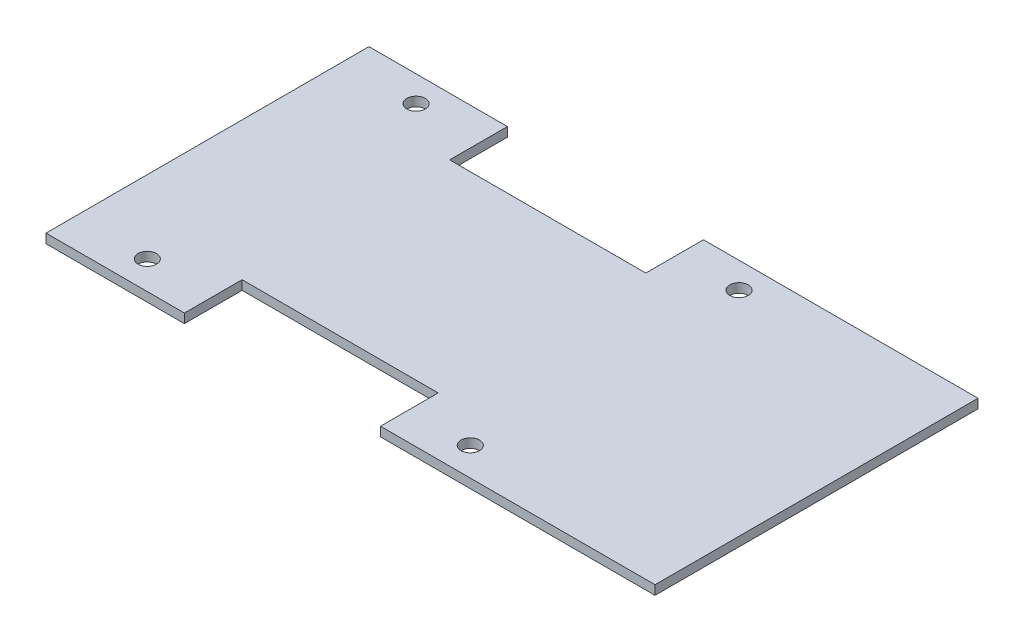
ISO-10303-21;
HEADER;
FILE_DESCRIPTION(('STEP AP214'),'2;1');
FILE_NAME('part.step','',(''),(''),'','','');
FILE_SCHEMA(('AUTOMOTIVE_DESIGN { 1 0 10303 214 1 1 1 1 }'));
ENDSEC;
DATA;
#1=APPLICATION_CONTEXT('core data for automotive mechanical design processes');
#2=APPLICATION_PROTOCOL_DEFINITION('international standard','automotive_design',2000,#1);
#3=PRODUCT_CONTEXT('',#1,'mechanical');
#4=PRODUCT('Part','Part','',(#3));
#5=PRODUCT_RELATED_PRODUCT_CATEGORY('part','',(#4));
#6=PRODUCT_DEFINITION_FORMATION('','',#4);
#7=PRODUCT_DEFINITION_CONTEXT('part definition',#1,'design');
#8=PRODUCT_DEFINITION('design','',#6,#7);
#9=PRODUCT_DEFINITION_SHAPE('','',#8);
#10=(LENGTH_UNIT() NAMED_UNIT(*) SI_UNIT(.MILLI.,.METRE.));
#11=(NAMED_UNIT(*) PLANE_ANGLE_UNIT() SI_UNIT($,.RADIAN.));
#12=(NAMED_UNIT(*) SI_UNIT($,.STERADIAN.) SOLID_ANGLE_UNIT());
#13=UNCERTAINTY_MEASURE_WITH_UNIT(LENGTH_MEASURE(1.E-05),#10,'distance_accuracy_value','');
#14=(GEOMETRIC_REPRESENTATION_CONTEXT(3) GLOBAL_UNCERTAINTY_ASSIGNED_CONTEXT((#13)) GLOBAL_UNIT_ASSIGNED_CONTEXT((#10,
#11,#12)) REPRESENTATION_CONTEXT('',''));
#15=CARTESIAN_POINT('',(0.,0.,0.));
#16=DIRECTION('',(0.,0.,1.));
#17=DIRECTION('',(1.,0.,0.));
#18=AXIS2_PLACEMENT_3D('',#15,#16,#17);
#19=CARTESIAN_POINT('',(-238.,-8.,-230.));
#20=DIRECTION('',(0.,0.,-1.));
#21=DIRECTION('',(-1.,0.,0.));
#22=AXIS2_PLACEMENT_3D('',#19,#20,#21);
#23=PLANE('',#22);
#24=DIRECTION('',(-1.,0.,0.));
#25=VECTOR('',#24,1.);
#26=CARTESIAN_POINT('',(-238.,0.,-230.));
#27=LINE('',#26,#25);
#28=CARTESIAN_POINT('',(-238.,0.,-230.));
#29=VERTEX_POINT('',#28);
#30=CARTESIAN_POINT('',(-408.,0.,-230.));
#31=VERTEX_POINT('',#30);
#32=EDGE_CURVE('E159',#29,#31,#27,.T.);
#33=ORIENTED_EDGE('',*,*,#32,.F.);
#34=DIRECTION('',(0.,1.,0.));
#35=VECTOR('',#34,1.);
#36=CARTESIAN_POINT('',(-238.,-8.,-230.));
#37=LINE('',#36,#35);
#38=CARTESIAN_POINT('',(-238.,-8.,-230.));
#39=VERTEX_POINT('',#38);
#40=EDGE_CURVE('E11',#39,#29,#37,.T.);
#41=ORIENTED_EDGE('',*,*,#40,.F.);
#42=DIRECTION('',(-1.,0.,0.));
#43=VECTOR('',#42,1.);
#44=CARTESIAN_POINT('',(-238.,-8.,-230.));
#45=LINE('',#44,#43);
#46=CARTESIAN_POINT('',(-408.,-8.,-230.));
#47=VERTEX_POINT('',#46);
#48=EDGE_CURVE('E192',#39,#47,#45,.T.);
#49=ORIENTED_EDGE('',*,*,#48,.T.);
#50=DIRECTION('',(0.,1.,0.));
#51=VECTOR('',#50,1.);
#52=CARTESIAN_POINT('',(-408.,-8.,-230.));
#53=LINE('',#52,#51);
#54=EDGE_CURVE('E41',#47,#31,#53,.T.);
#55=ORIENTED_EDGE('',*,*,#54,.T.);
#56=EDGE_LOOP('',(#33,#41,#49,#55));
#57=FACE_BOUND('',#56,.T.);
#58=ADVANCED_FACE('F38',(#57),#23,.T.);
#59=CARTESIAN_POINT('',(-238.,-8.,-230.));
#60=DIRECTION('',(-1.,0.,0.));
#61=DIRECTION('',(0.,0.,1.));
#62=AXIS2_PLACEMENT_3D('',#59,#60,#61);
#63=PLANE('',#62);
#64=DIRECTION('',(0.,0.,1.));
#65=VECTOR('',#64,1.);
#66=CARTESIAN_POINT('',(-238.,0.,-230.));
#67=LINE('',#66,#65);
#68=CARTESIAN_POINT('',(-238.,0.,-280.));
#69=VERTEX_POINT('',#68);
#70=EDGE_CURVE('E190',#69,#29,#67,.T.);
#71=ORIENTED_EDGE('',*,*,#70,.F.);
#72=DIRECTION('',(0.,1.,0.));
#73=VECTOR('',#72,1.);
#74=CARTESIAN_POINT('',(-238.,-8.,-280.));
#75=LINE('',#74,#73);
#76=CARTESIAN_POINT('',(-238.,-8.,-280.));
#77=VERTEX_POINT('',#76);
#78=EDGE_CURVE('E47',#77,#69,#75,.T.);
#79=ORIENTED_EDGE('',*,*,#78,.F.);
#80=DIRECTION('',(0.,0.,1.));
#81=VECTOR('',#80,1.);
#82=CARTESIAN_POINT('',(-238.,-8.,-230.));
#83=LINE('',#82,#81);
#84=EDGE_CURVE('E149',#77,#39,#83,.T.);
#85=ORIENTED_EDGE('',*,*,#84,.T.);
#86=ORIENTED_EDGE('',*,*,#40,.T.);
#87=EDGE_LOOP('',(#71,#79,#85,#86));
#88=FACE_BOUND('',#87,.T.);
#89=ADVANCED_FACE('F212',(#88),#63,.T.);
#90=CARTESIAN_POINT('',(-238.,-8.,-280.));
#91=DIRECTION('',(0.,0.,-1.));
#92=DIRECTION('',(-1.,0.,0.));
#93=AXIS2_PLACEMENT_3D('',#90,#91,#92);
#94=PLANE('',#93);
#95=DIRECTION('',(-1.,0.,0.));
#96=VECTOR('',#95,1.);
#97=CARTESIAN_POINT('',(-238.,0.,-280.));
#98=LINE('',#97,#96);
#99=CARTESIAN_POINT('',(0.,0.,-280.));
#100=VERTEX_POINT('',#99);
#101=EDGE_CURVE('E136',#100,#69,#98,.T.);
#102=ORIENTED_EDGE('',*,*,#101,.F.);
#103=DIRECTION('',(0.,1.,0.));
#104=VECTOR('',#103,1.);
#105=CARTESIAN_POINT('',(0.,-8.,-280.));
#106=LINE('',#105,#104);
#107=CARTESIAN_POINT('',(0.,-8.,-280.));
#108=VERTEX_POINT('',#107);
#109=EDGE_CURVE('E131',#108,#100,#106,.T.);
#110=ORIENTED_EDGE('',*,*,#109,.F.);
#111=DIRECTION('',(-1.,0.,0.));
#112=VECTOR('',#111,1.);
#113=CARTESIAN_POINT('',(-238.,-8.,-280.));
#114=LINE('',#113,#112);
#115=EDGE_CURVE('E134',#108,#77,#114,.T.);
#116=ORIENTED_EDGE('',*,*,#115,.T.);
#117=ORIENTED_EDGE('',*,*,#78,.T.);
#118=EDGE_LOOP('',(#102,#110,#116,#117));
#119=FACE_BOUND('',#118,.T.);
#120=ADVANCED_FACE('F133',(#119),#94,.T.);
#121=CARTESIAN_POINT('',(0.,-8.,0.));
#122=DIRECTION('',(1.,0.,0.));
#123=DIRECTION('',(0.,0.,-1.));
#124=AXIS2_PLACEMENT_3D('',#121,#122,#123);
#125=PLANE('',#124);
#126=DIRECTION('',(0.,0.,-1.));
#127=VECTOR('',#126,1.);
#128=CARTESIAN_POINT('',(0.,0.,0.));
#129=LINE('',#128,#127);
#130=CARTESIAN_POINT('',(0.,0.,0.));
#131=VERTEX_POINT('',#130);
#132=EDGE_CURVE('E187',#131,#100,#129,.T.);
#133=ORIENTED_EDGE('',*,*,#132,.F.);
#134=DIRECTION('',(0.,1.,0.));
#135=VECTOR('',#134,1.);
#136=CARTESIAN_POINT('',(0.,-8.,0.));
#137=LINE('',#136,#135);
#138=CARTESIAN_POINT('',(0.,-8.,0.));
#139=VERTEX_POINT('',#138);
#140=EDGE_CURVE('E141',#139,#131,#137,.T.);
#141=ORIENTED_EDGE('',*,*,#140,.F.);
#142=DIRECTION('',(0.,0.,-1.));
#143=VECTOR('',#142,1.);
#144=CARTESIAN_POINT('',(0.,-8.,0.));
#145=LINE('',#144,#143);
#146=EDGE_CURVE('E147',#139,#108,#145,.T.);
#147=ORIENTED_EDGE('',*,*,#146,.T.);
#148=ORIENTED_EDGE('',*,*,#109,.T.);
#149=EDGE_LOOP('',(#133,#141,#147,#148));
#150=FACE_BOUND('',#149,.T.);
#151=ADVANCED_FACE('F151',(#150),#125,.T.);
#152=CARTESIAN_POINT('',(0.,-8.,0.));
#153=DIRECTION('',(0.,0.,1.));
#154=DIRECTION('',(1.,0.,0.));
#155=AXIS2_PLACEMENT_3D('',#152,#153,#154);
#156=PLANE('',#155);
#157=DIRECTION('',(1.,0.,0.));
#158=VECTOR('',#157,1.);
#159=CARTESIAN_POINT('',(0.,0.,0.));
#160=LINE('',#159,#158);
#161=CARTESIAN_POINT('',(-238.,0.,0.));
#162=VERTEX_POINT('',#161);
#163=EDGE_CURVE('E184',#162,#131,#160,.T.);
#164=ORIENTED_EDGE('',*,*,#163,.F.);
#165=DIRECTION('',(0.,1.,0.));
#166=VECTOR('',#165,1.);
#167=CARTESIAN_POINT('',(-238.,-8.,0.));
#168=LINE('',#167,#166);
#169=CARTESIAN_POINT('',(-238.,-8.,0.));
#170=VERTEX_POINT('',#169);
#171=EDGE_CURVE('E196',#170,#162,#168,.T.);
#172=ORIENTED_EDGE('',*,*,#171,.F.);
#173=DIRECTION('',(1.,0.,0.));
#174=VECTOR('',#173,1.);
#175=CARTESIAN_POINT('',(0.,-8.,0.));
#176=LINE('',#175,#174);
#177=EDGE_CURVE('E152',#170,#139,#176,.T.);
#178=ORIENTED_EDGE('',*,*,#177,.T.);
#179=ORIENTED_EDGE('',*,*,#140,.T.);
#180=EDGE_LOOP('',(#164,#172,#178,#179));
#181=FACE_BOUND('',#180,.T.);
#182=ADVANCED_FACE('F225',(#181),#156,.T.);
#183=CARTESIAN_POINT('',(-238.,-8.,0.));
#184=DIRECTION('',(-1.,0.,0.));
#185=DIRECTION('',(0.,0.,1.));
#186=AXIS2_PLACEMENT_3D('',#183,#184,#185);
#187=PLANE('',#186);
#188=DIRECTION('',(0.,0.,1.));
#189=VECTOR('',#188,1.);
#190=CARTESIAN_POINT('',(-238.,0.,0.));
#191=LINE('',#190,#189);
#192=CARTESIAN_POINT('',(-238.,0.,-50.));
#193=VERTEX_POINT('',#192);
#194=EDGE_CURVE('E181',#193,#162,#191,.T.);
#195=ORIENTED_EDGE('',*,*,#194,.F.);
#196=DIRECTION('',(0.,1.,0.));
#197=VECTOR('',#196,1.);
#198=CARTESIAN_POINT('',(-238.,-8.,-50.));
#199=LINE('',#198,#197);
#200=CARTESIAN_POINT('',(-238.,-8.,-50.));
#201=VERTEX_POINT('',#200);
#202=EDGE_CURVE('E198',#201,#193,#199,.T.);
#203=ORIENTED_EDGE('',*,*,#202,.F.);
#204=DIRECTION('',(0.,0.,1.));
#205=VECTOR('',#204,1.);
#206=CARTESIAN_POINT('',(-238.,-8.,0.));
#207=LINE('',#206,#205);
#208=EDGE_CURVE('E154',#201,#170,#207,.T.);
#209=ORIENTED_EDGE('',*,*,#208,.T.);
#210=ORIENTED_EDGE('',*,*,#171,.T.);
#211=EDGE_LOOP('',(#195,#203,#209,#210));
#212=FACE_BOUND('',#211,.T.);
#213=ADVANCED_FACE('F228',(#212),#187,.T.);
#214=CARTESIAN_POINT('',(-238.,-8.,-50.));
#215=DIRECTION('',(0.,0.,1.));
#216=DIRECTION('',(1.,0.,0.));
#217=AXIS2_PLACEMENT_3D('',#214,#215,#216);
#218=PLANE('',#217);
#219=DIRECTION('',(1.,0.,0.));
#220=VECTOR('',#219,1.);
#221=CARTESIAN_POINT('',(-238.,0.,-50.));
#222=LINE('',#221,#220);
#223=CARTESIAN_POINT('',(-408.,0.,-50.));
#224=VERTEX_POINT('',#223);
#225=EDGE_CURVE('E178',#224,#193,#222,.T.);
#226=ORIENTED_EDGE('',*,*,#225,.F.);
#227=DIRECTION('',(0.,1.,0.));
#228=VECTOR('',#227,1.);
#229=CARTESIAN_POINT('',(-408.,-8.,-50.));
#230=LINE('',#229,#228);
#231=CARTESIAN_POINT('',(-408.,-8.,-50.));
#232=VERTEX_POINT('',#231);
#233=EDGE_CURVE('E200',#232,#224,#230,.T.);
#234=ORIENTED_EDGE('',*,*,#233,.F.);
#235=DIRECTION('',(1.,0.,0.));
#236=VECTOR('',#235,1.);
#237=CARTESIAN_POINT('',(-238.,-8.,-50.));
#238=LINE('',#237,#236);
#239=EDGE_CURVE('E324',#232,#201,#238,.T.);
#240=ORIENTED_EDGE('',*,*,#239,.T.);
#241=ORIENTED_EDGE('',*,*,#202,.T.);
#242=EDGE_LOOP('',(#226,#234,#240,#241));
#243=FACE_BOUND('',#242,.T.);
#244=ADVANCED_FACE('F232',(#243),#218,.T.);
#245=CARTESIAN_POINT('',(-408.,-8.,0.));
#246=DIRECTION('',(1.,0.,0.));
#247=DIRECTION('',(0.,0.,-1.));
#248=AXIS2_PLACEMENT_3D('',#245,#246,#247);
#249=PLANE('',#248);
#250=DIRECTION('',(0.,0.,-1.));
#251=VECTOR('',#250,1.);
#252=CARTESIAN_POINT('',(-408.,0.,0.));
#253=LINE('',#252,#251);
#254=CARTESIAN_POINT('',(-408.,0.,0.));
#255=VERTEX_POINT('',#254);
#256=EDGE_CURVE('E175',#255,#224,#253,.T.);
#257=ORIENTED_EDGE('',*,*,#256,.F.);
#258=DIRECTION('',(0.,1.,0.));
#259=VECTOR('',#258,1.);
#260=CARTESIAN_POINT('',(-408.,-8.,0.));
#261=LINE('',#260,#259);
#262=CARTESIAN_POINT('',(-408.,-8.,0.));
#263=VERTEX_POINT('',#262);
#264=EDGE_CURVE('E202',#263,#255,#261,.T.);
#265=ORIENTED_EDGE('',*,*,#264,.F.);
#266=DIRECTION('',(0.,0.,-1.));
#267=VECTOR('',#266,1.);
#268=CARTESIAN_POINT('',(-408.,-8.,0.));
#269=LINE('',#268,#267);
#270=EDGE_CURVE('E321',#263,#232,#269,.T.);
#271=ORIENTED_EDGE('',*,*,#270,.T.);
#272=ORIENTED_EDGE('',*,*,#233,.T.);
#273=EDGE_LOOP('',(#257,#265,#271,#272));
#274=FACE_BOUND('',#273,.T.);
#275=ADVANCED_FACE('F236',(#274),#249,.T.);
#276=CARTESIAN_POINT('',(-528.,-8.,0.));
#277=DIRECTION('',(0.,0.,1.));
#278=DIRECTION('',(1.,0.,0.));
#279=AXIS2_PLACEMENT_3D('',#276,#277,#278);
#280=PLANE('',#279);
#281=DIRECTION('',(1.,0.,0.));
#282=VECTOR('',#281,1.);
#283=CARTESIAN_POINT('',(-528.,0.,0.));
#284=LINE('',#283,#282);
#285=CARTESIAN_POINT('',(-528.,0.,0.));
#286=VERTEX_POINT('',#285);
#287=EDGE_CURVE('E172',#286,#255,#284,.T.);
#288=ORIENTED_EDGE('',*,*,#287,.F.);
#289=DIRECTION('',(0.,1.,0.));
#290=VECTOR('',#289,1.);
#291=CARTESIAN_POINT('',(-528.,-8.,0.));
#292=LINE('',#291,#290);
#293=CARTESIAN_POINT('',(-528.,-8.,0.));
#294=VERTEX_POINT('',#293);
#295=EDGE_CURVE('E204',#294,#286,#292,.T.);
#296=ORIENTED_EDGE('',*,*,#295,.F.);
#297=DIRECTION('',(1.,0.,0.));
#298=VECTOR('',#297,1.);
#299=CARTESIAN_POINT('',(-528.,-8.,0.));
#300=LINE('',#299,#298);
#301=EDGE_CURVE('E318',#294,#263,#300,.T.);
#302=ORIENTED_EDGE('',*,*,#301,.T.);
#303=ORIENTED_EDGE('',*,*,#264,.T.);
#304=EDGE_LOOP('',(#288,#296,#302,#303));
#305=FACE_BOUND('',#304,.T.);
#306=ADVANCED_FACE('F240',(#305),#280,.T.);
#307=CARTESIAN_POINT('',(-528.,-8.,-280.));
#308=DIRECTION('',(-1.,0.,0.));
#309=DIRECTION('',(0.,0.,1.));
#310=AXIS2_PLACEMENT_3D('',#307,#308,#309);
#311=PLANE('',#310);
#312=DIRECTION('',(0.,0.,1.));
#313=VECTOR('',#312,1.);
#314=CARTESIAN_POINT('',(-528.,0.,-280.));
#315=LINE('',#314,#313);
#316=CARTESIAN_POINT('',(-528.,0.,-280.));
#317=VERTEX_POINT('',#316);
#318=EDGE_CURVE('E169',#317,#286,#315,.T.);
#319=ORIENTED_EDGE('',*,*,#318,.F.);
#320=DIRECTION('',(0.,1.,0.));
#321=VECTOR('',#320,1.);
#322=CARTESIAN_POINT('',(-528.,-8.,-280.));
#323=LINE('',#322,#321);
#324=CARTESIAN_POINT('',(-528.,-8.,-280.));
#325=VERTEX_POINT('',#324);
#326=EDGE_CURVE('E206',#325,#317,#323,.T.);
#327=ORIENTED_EDGE('',*,*,#326,.F.);
#328=DIRECTION('',(0.,0.,1.));
#329=VECTOR('',#328,1.);
#330=CARTESIAN_POINT('',(-528.,-8.,-280.));
#331=LINE('',#330,#329);
#332=EDGE_CURVE('E315',#325,#294,#331,.T.);
#333=ORIENTED_EDGE('',*,*,#332,.T.);
#334=ORIENTED_EDGE('',*,*,#295,.T.);
#335=EDGE_LOOP('',(#319,#327,#333,#334));
#336=FACE_BOUND('',#335,.T.);
#337=ADVANCED_FACE('F244',(#336),#311,.T.);
#338=CARTESIAN_POINT('',(-408.,-8.,-280.));
#339=DIRECTION('',(0.,0.,-1.));
#340=DIRECTION('',(-1.,0.,0.));
#341=AXIS2_PLACEMENT_3D('',#338,#339,#340);
#342=PLANE('',#341);
#343=DIRECTION('',(-1.,0.,0.));
#344=VECTOR('',#343,1.);
#345=CARTESIAN_POINT('',(-408.,0.,-280.));
#346=LINE('',#345,#344);
#347=CARTESIAN_POINT('',(-408.,0.,-280.));
#348=VERTEX_POINT('',#347);
#349=EDGE_CURVE('E166',#348,#317,#346,.T.);
#350=ORIENTED_EDGE('',*,*,#349,.F.);
#351=DIRECTION('',(0.,1.,0.));
#352=VECTOR('',#351,1.);
#353=CARTESIAN_POINT('',(-408.,-8.,-280.));
#354=LINE('',#353,#352);
#355=CARTESIAN_POINT('',(-408.,-8.,-280.));
#356=VERTEX_POINT('',#355);
#357=EDGE_CURVE('E207',#356,#348,#354,.T.);
#358=ORIENTED_EDGE('',*,*,#357,.F.);
#359=DIRECTION('',(-1.,0.,0.));
#360=VECTOR('',#359,1.);
#361=CARTESIAN_POINT('',(-408.,-8.,-280.));
#362=LINE('',#361,#360);
#363=EDGE_CURVE('E312',#356,#325,#362,.T.);
#364=ORIENTED_EDGE('',*,*,#363,.T.);
#365=ORIENTED_EDGE('',*,*,#326,.T.);
#366=EDGE_LOOP('',(#350,#358,#364,#365));
#367=FACE_BOUND('',#366,.T.);
#368=ADVANCED_FACE('F248',(#367),#342,.T.);
#369=CARTESIAN_POINT('',(-408.,-8.,-230.));
#370=DIRECTION('',(1.,0.,0.));
#371=DIRECTION('',(0.,0.,-1.));
#372=AXIS2_PLACEMENT_3D('',#369,#370,#371);
#373=PLANE('',#372);
#374=DIRECTION('',(0.,0.,-1.));
#375=VECTOR('',#374,1.);
#376=CARTESIAN_POINT('',(-408.,0.,-230.));
#377=LINE('',#376,#375);
#378=EDGE_CURVE('E162',#31,#348,#377,.T.);
#379=ORIENTED_EDGE('',*,*,#378,.F.);
#380=ORIENTED_EDGE('',*,*,#54,.F.);
#381=DIRECTION('',(0.,0.,-1.));
#382=VECTOR('',#381,1.);
#383=CARTESIAN_POINT('',(-408.,-8.,-230.));
#384=LINE('',#383,#382);
#385=EDGE_CURVE('E310',#47,#356,#384,.T.);
#386=ORIENTED_EDGE('',*,*,#385,.T.);
#387=ORIENTED_EDGE('',*,*,#357,.T.);
#388=EDGE_LOOP('',(#379,#380,#386,#387));
#389=FACE_BOUND('',#388,.T.);
#390=ADVANCED_FACE('F209',(#389),#373,.T.);
#391=CARTESIAN_POINT('',(0.,-8.,0.));
#392=DIRECTION('',(0.,-1.,0.));
#393=DIRECTION('',(0.,0.,-1.));
#394=AXIS2_PLACEMENT_3D('',#391,#392,#393);
#395=PLANE('',#394);
#396=CARTESIAN_POINT('',(-464.743882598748,-8.,-24.5663706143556));
#397=DIRECTION('',(0.,-1.,0.));
#398=DIRECTION('',(0.,0.,-1.));
#399=AXIS2_PLACEMENT_3D('',#396,#397,#398);
#400=CIRCLE('',#399,7.99999999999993);
#401=CARTESIAN_POINT('',(-464.743882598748,-8.,-32.5663706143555));
#402=VERTEX_POINT('',#401);
#403=EDGE_CURVE('E163',#402,#402,#400,.T.);
#404=ORIENTED_EDGE('',*,*,#403,.F.);
#405=EDGE_LOOP('',(#404));
#406=FACE_BOUND('',#405,.T.);
#407=CARTESIAN_POINT('',(-184.74388259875,-8.,-257.566370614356));
#408=DIRECTION('',(0.,-1.,0.));
#409=DIRECTION('',(0.,0.,-1.));
#410=AXIS2_PLACEMENT_3D('',#407,#408,#409);
#411=CIRCLE('',#410,8.00000000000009);
#412=CARTESIAN_POINT('',(-184.74388259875,-8.,-265.566370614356));
#413=VERTEX_POINT('',#412);
#414=EDGE_CURVE('E304',#413,#413,#411,.T.);
#415=ORIENTED_EDGE('',*,*,#414,.F.);
#416=EDGE_LOOP('',(#415));
#417=FACE_BOUND('',#416,.T.);
#418=CARTESIAN_POINT('',(-184.74388259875,-8.,-24.5663706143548));
#419=DIRECTION('',(0.,-1.,0.));
#420=DIRECTION('',(0.,0.,-1.));
#421=AXIS2_PLACEMENT_3D('',#418,#419,#420);
#422=CIRCLE('',#421,7.99999999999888);
#423=CARTESIAN_POINT('',(-184.74388259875,-8.,-32.5663706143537));
#424=VERTEX_POINT('',#423);
#425=EDGE_CURVE('E284',#424,#424,#422,.T.);
#426=ORIENTED_EDGE('',*,*,#425,.F.);
#427=EDGE_LOOP('',(#426));
#428=FACE_BOUND('',#427,.T.);
#429=CARTESIAN_POINT('',(-464.743882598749,-8.,-257.566370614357));
#430=DIRECTION('',(0.,-1.,0.));
#431=DIRECTION('',(0.,0.,-1.));
#432=AXIS2_PLACEMENT_3D('',#429,#430,#431);
#433=CIRCLE('',#432,8.00000000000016);
#434=CARTESIAN_POINT('',(-464.743882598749,-8.,-265.566370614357));
#435=VERTEX_POINT('',#434);
#436=EDGE_CURVE('E300',#435,#435,#433,.T.);
#437=ORIENTED_EDGE('',*,*,#436,.F.);
#438=EDGE_LOOP('',(#437));
#439=FACE_BOUND('',#438,.T.);
#440=ORIENTED_EDGE('',*,*,#48,.F.);
#441=ORIENTED_EDGE('',*,*,#84,.F.);
#442=ORIENTED_EDGE('',*,*,#115,.F.);
#443=ORIENTED_EDGE('',*,*,#146,.F.);
#444=ORIENTED_EDGE('',*,*,#177,.F.);
#445=ORIENTED_EDGE('',*,*,#208,.F.);
#446=ORIENTED_EDGE('',*,*,#239,.F.);
#447=ORIENTED_EDGE('',*,*,#270,.F.);
#448=ORIENTED_EDGE('',*,*,#301,.F.);
#449=ORIENTED_EDGE('',*,*,#332,.F.);
#450=ORIENTED_EDGE('',*,*,#363,.F.);
#451=ORIENTED_EDGE('',*,*,#385,.F.);
#452=EDGE_LOOP('',(#440,#441,#442,#443,#444,#445,#446,#447,#448,#449,#450,#451));
#453=FACE_BOUND('',#452,.T.);
#454=ADVANCED_FACE('F145',(#406,#417,#428,#439,#453),#395,.T.);
#455=CARTESIAN_POINT('',(0.,0.,0.));
#456=DIRECTION('',(0.,-1.,0.));
#457=DIRECTION('',(0.,0.,-1.));
#458=AXIS2_PLACEMENT_3D('',#455,#456,#457);
#459=PLANE('',#458);
#460=CARTESIAN_POINT('',(-464.743882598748,0.,-24.5663706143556));
#461=DIRECTION('',(0.,1.,0.));
#462=DIRECTION('',(0.,0.,1.));
#463=AXIS2_PLACEMENT_3D('',#460,#461,#462);
#464=CIRCLE('',#463,7.99999999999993);
#465=CARTESIAN_POINT('',(-464.743882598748,0.,-16.5663706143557));
#466=VERTEX_POINT('',#465);
#467=EDGE_CURVE('E292',#466,#466,#464,.T.);
#468=ORIENTED_EDGE('',*,*,#467,.F.);
#469=EDGE_LOOP('',(#468));
#470=FACE_BOUND('',#469,.T.);
#471=CARTESIAN_POINT('',(-184.74388259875,0.,-257.566370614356));
#472=DIRECTION('',(0.,1.,0.));
#473=DIRECTION('',(0.,0.,1.));
#474=AXIS2_PLACEMENT_3D('',#471,#472,#473);
#475=CIRCLE('',#474,8.00000000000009);
#476=CARTESIAN_POINT('',(-184.74388259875,0.,-249.566370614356));
#477=VERTEX_POINT('',#476);
#478=EDGE_CURVE('E289',#477,#477,#475,.T.);
#479=ORIENTED_EDGE('',*,*,#478,.F.);
#480=EDGE_LOOP('',(#479));
#481=FACE_BOUND('',#480,.T.);
#482=CARTESIAN_POINT('',(-184.74388259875,0.,-24.5663706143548));
#483=DIRECTION('',(0.,1.,0.));
#484=DIRECTION('',(0.,0.,1.));
#485=AXIS2_PLACEMENT_3D('',#482,#483,#484);
#486=CIRCLE('',#485,7.99999999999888);
#487=CARTESIAN_POINT('',(-184.74388259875,0.,-16.5663706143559));
#488=VERTEX_POINT('',#487);
#489=EDGE_CURVE('E287',#488,#488,#486,.T.);
#490=ORIENTED_EDGE('',*,*,#489,.F.);
#491=EDGE_LOOP('',(#490));
#492=FACE_BOUND('',#491,.T.);
#493=CARTESIAN_POINT('',(-464.743882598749,0.,-257.566370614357));
#494=DIRECTION('',(0.,1.,0.));
#495=DIRECTION('',(0.,0.,1.));
#496=AXIS2_PLACEMENT_3D('',#493,#494,#495);
#497=CIRCLE('',#496,8.00000000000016);
#498=CARTESIAN_POINT('',(-464.743882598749,0.,-249.566370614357));
#499=VERTEX_POINT('',#498);
#500=EDGE_CURVE('E296',#499,#499,#497,.T.);
#501=ORIENTED_EDGE('',*,*,#500,.F.);
#502=EDGE_LOOP('',(#501));
#503=FACE_BOUND('',#502,.T.);
#504=ORIENTED_EDGE('',*,*,#32,.T.);
#505=ORIENTED_EDGE('',*,*,#378,.T.);
#506=ORIENTED_EDGE('',*,*,#349,.T.);
#507=ORIENTED_EDGE('',*,*,#318,.T.);
#508=ORIENTED_EDGE('',*,*,#287,.T.);
#509=ORIENTED_EDGE('',*,*,#256,.T.);
#510=ORIENTED_EDGE('',*,*,#225,.T.);
#511=ORIENTED_EDGE('',*,*,#194,.T.);
#512=ORIENTED_EDGE('',*,*,#163,.T.);
#513=ORIENTED_EDGE('',*,*,#132,.T.);
#514=ORIENTED_EDGE('',*,*,#101,.T.);
#515=ORIENTED_EDGE('',*,*,#70,.T.);
#516=EDGE_LOOP('',(#504,#505,#506,#507,#508,#509,#510,#511,#512,#513,#514,#515));
#517=FACE_BOUND('',#516,.T.);
#518=ADVANCED_FACE('F211',(#470,#481,#492,#503,#517),#459,.F.);
#519=CARTESIAN_POINT('',(-464.743882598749,-10.,-257.566370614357));
#520=DIRECTION('',(0.,1.,0.));
#521=DIRECTION('',(0.,0.,1.));
#522=AXIS2_PLACEMENT_3D('',#519,#520,#521);
#523=CYLINDRICAL_SURFACE('',#522,8.00000000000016);
#524=ORIENTED_EDGE('',*,*,#436,.T.);
#525=EDGE_LOOP('',(#524));
#526=FACE_BOUND('',#525,.T.);
#527=ORIENTED_EDGE('',*,*,#500,.T.);
#528=EDGE_LOOP('',(#527));
#529=FACE_BOUND('',#528,.T.);
#530=ADVANCED_FACE('F260',(#526,#529),#523,.F.);
#531=CARTESIAN_POINT('',(-184.74388259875,-10.,-24.5663706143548));
#532=DIRECTION('',(0.,1.,0.));
#533=DIRECTION('',(0.,0.,1.));
#534=AXIS2_PLACEMENT_3D('',#531,#532,#533);
#535=CYLINDRICAL_SURFACE('',#534,7.99999999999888);
#536=ORIENTED_EDGE('',*,*,#425,.T.);
#537=EDGE_LOOP('',(#536));
#538=FACE_BOUND('',#537,.T.);
#539=ORIENTED_EDGE('',*,*,#489,.T.);
#540=EDGE_LOOP('',(#539));
#541=FACE_BOUND('',#540,.T.);
#542=ADVANCED_FACE('F267',(#538,#541),#535,.F.);
#543=CARTESIAN_POINT('',(-184.74388259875,-10.,-257.566370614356));
#544=DIRECTION('',(0.,1.,0.));
#545=DIRECTION('',(0.,0.,1.));
#546=AXIS2_PLACEMENT_3D('',#543,#544,#545);
#547=CYLINDRICAL_SURFACE('',#546,8.00000000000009);
#548=ORIENTED_EDGE('',*,*,#414,.T.);
#549=EDGE_LOOP('',(#548));
#550=FACE_BOUND('',#549,.T.);
#551=ORIENTED_EDGE('',*,*,#478,.T.);
#552=EDGE_LOOP('',(#551));
#553=FACE_BOUND('',#552,.T.);
#554=ADVANCED_FACE('F269',(#550,#553),#547,.F.);
#555=CARTESIAN_POINT('',(-464.743882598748,-10.,-24.5663706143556));
#556=DIRECTION('',(0.,1.,0.));
#557=DIRECTION('',(0.,0.,1.));
#558=AXIS2_PLACEMENT_3D('',#555,#556,#557);
#559=CYLINDRICAL_SURFACE('',#558,7.99999999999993);
#560=ORIENTED_EDGE('',*,*,#403,.T.);
#561=EDGE_LOOP('',(#560));
#562=FACE_BOUND('',#561,.T.);
#563=ORIENTED_EDGE('',*,*,#467,.T.);
#564=EDGE_LOOP('',(#563));
#565=FACE_BOUND('',#564,.T.);
#566=ADVANCED_FACE('F272',(#562,#565),#559,.F.);
#567=CLOSED_SHELL('',(#58,#89,#120,#151,#182,#213,#244,#275,#306,#337,#368,#390,#454,#518,#530,
#542,#554,#566));
#568=MANIFOLD_SOLID_BREP('B2',#567);
#569=ADVANCED_BREP_SHAPE_REPRESENTATION('',(#18,#568),#14);
#570=SHAPE_DEFINITION_REPRESENTATION(#9,#569);
ENDSEC;
END-ISO-10303-21;
